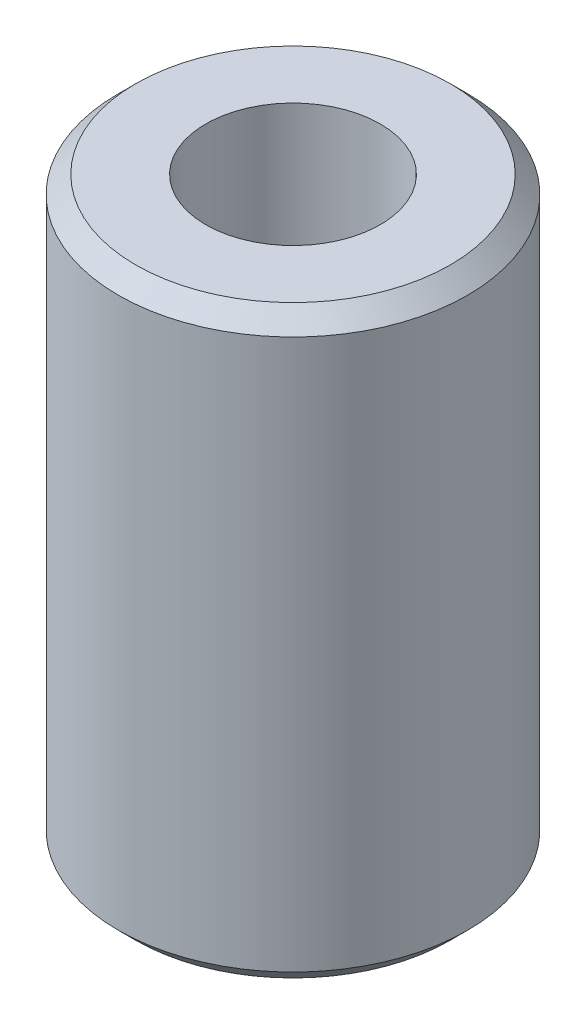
from build123d import *

# Parameters (mm, degrees)
ESQUISSE1_R        = 5
ESQUISSE1_R_2      = 2.5
BOSS_EXTRU_1_DEPTH = 16.75
CHANFREIN1_SIZE    = 0.5


with BuildPart() as part:
    # Esquisse1 → Boss.-Extru.1 (new body)
    with BuildSketch(Plane(origin=(0, 0, 0), x_dir=(1, 0, 0), z_dir=(0, 1, 0))):
        with Locations(Location((0, 0, 0), (0, 0, 270))):
            Circle(ESQUISSE1_R)
        with Locations(Location((0, 0, 0), (0, 0, 270))):
            Circle(ESQUISSE1_R_2, mode=Mode.SUBTRACT)
    extrude(amount=BOSS_EXTRU_1_DEPTH)

    # Chanfrein1
    chanfrein1_edges = [part.edges().sort_by_distance(p)[0] for p in [
        (0, 0, -5),
        (0, 16.75, -5),
        (0, 0, -2.5),
    ]]
    chamfer(chanfrein1_edges, length=CHANFREIN1_SIZE)


solid = part.part
